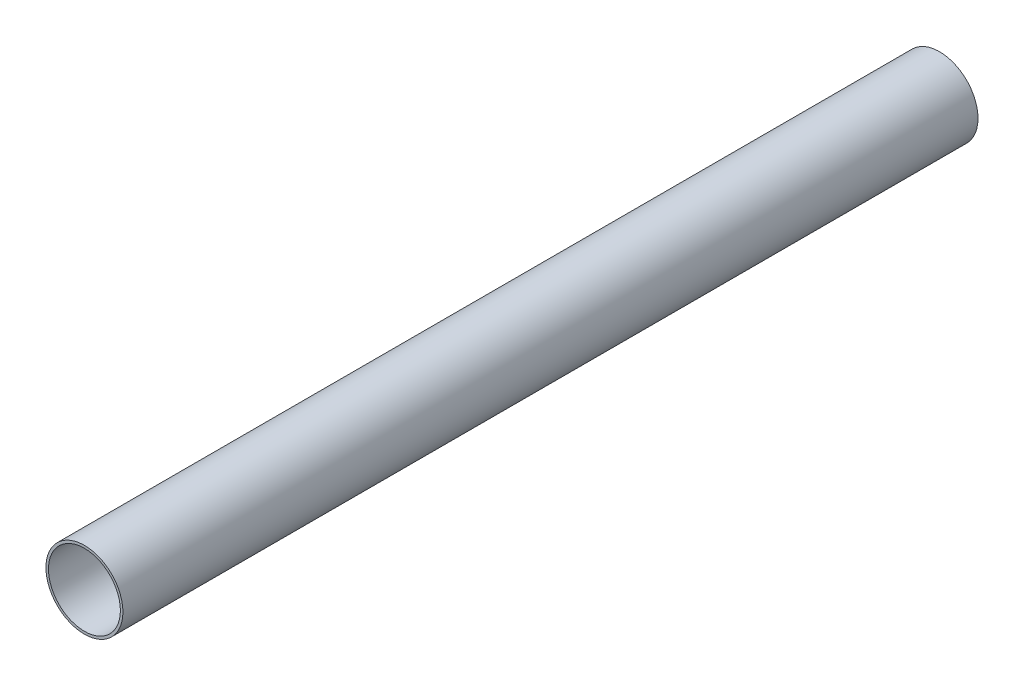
from build123d import *

# Parameters (mm, degrees)
SKETCH1_R           = 26.9875
SKETCH1_R_2         = 25.2095
BOSS_EXTRUDE1_DEPTH = 599.44


with BuildPart() as part:
    # Sketch1 → Boss-Extrude1 (new body)
    with BuildSketch(Plane.XY):
        Circle(SKETCH1_R)
        Circle(SKETCH1_R_2, mode=Mode.SUBTRACT)
    extrude(amount=BOSS_EXTRUDE1_DEPTH)


solid = part.part
